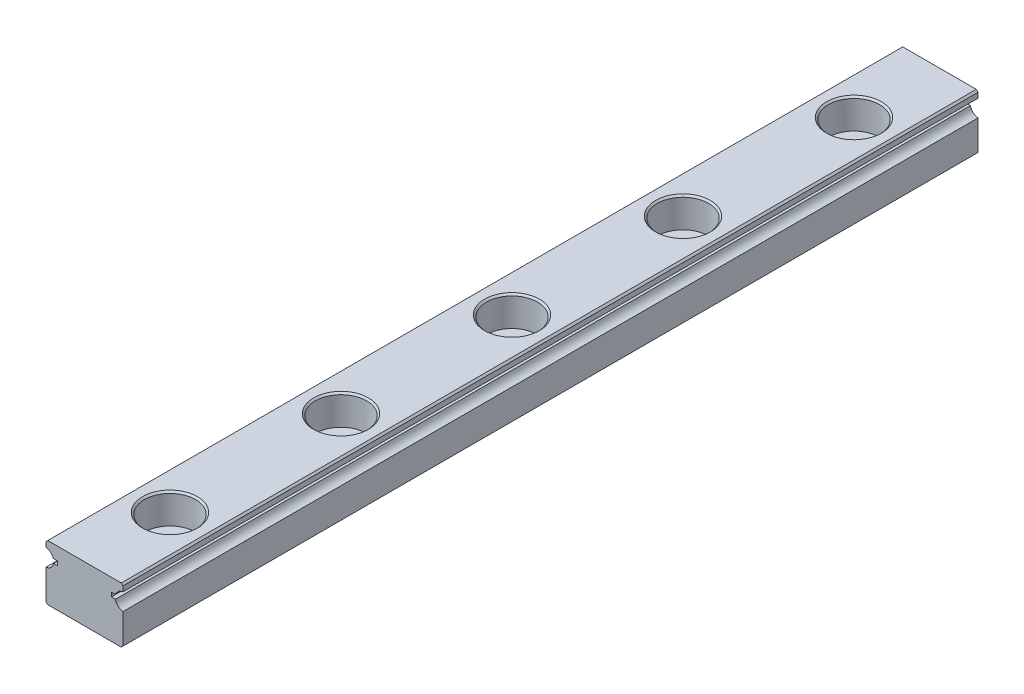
from build123d import *

# Parameters (mm, degrees)
EXTRUDE1_DEPTH             = 250
EXTRUDE2_REACH             = 252.125
SKETCH2_R                  = 1.75
SKETCH_R                   = 3
SKETCH_R_2                 = 1.75
EXTRUDE4_DEPTH             = 3.5
CHAMFER1_SIZE              = 0.2
LPATTERN1_COUNT            = 12
LPATTERN1_PITCH            = 20
CHAMFER1_OF_LPATTERN1_SIZE = 0.2
SKETCH_1_OUTSIDE_W         = 61.05
SKETCH_1_OUTSIDE_H         = 302.05
SKETCH_1_OUTSIDE_W_2       = 30
SKETCH_1_OUTSIDE_H_2       = 100
CUT_EXTRUDE_1_DEPTH        = 10


with BuildPart() as part:
    # Sketch1 → Extrude1 (new body)
    with BuildSketch(Plane.XY):
        with BuildLine():
            Line((-4.3, -3.25), (4.3, -3.25))
            Line((4.3, -3.25), (4.5, -3.05))
            Line((4.5, -3.05), (4.5, 0.455012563))
            ThreePointArc((4.5, 0.455012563), (3.924845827, 0.712323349), (3.617735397, 1.2625))
            Line((3.617735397, 1.2625), (3.15008224, 1.2625))
            Line((3.15008224, 1.2625), (3.15008224, 1.7625))
            Line((3.15008224, 1.7625), (3.65008224, 1.7625))
            ThreePointArc((3.65008224, 1.7625), (3.973877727, 2.229724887), (4.5, 2.444987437))
            Line((4.5, 2.444987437), (4.5, 3.05))
            Line((4.5, 3.05), (4.3, 3.25))
            Line((4.3, 3.25), (-4.3, 3.25))
            Line((-4.3, 3.25), (-4.5, 3.05))
            Line((-4.5, 3.05), (-4.5, 2.444987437))
            ThreePointArc((-4.5, 2.444987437), (-3.973877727, 2.229724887), (-3.65008224, 1.7625))
            Line((-3.65008224, 1.7625), (-3.15008224, 1.7625))
            Line((-3.15008224, 1.7625), (-3.15008224, 1.2625))
            Line((-3.15008224, 1.2625), (-3.617735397, 1.2625))
            ThreePointArc((-3.617735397, 1.2625), (-3.924845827, 0.712323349), (-4.5, 0.455012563))
            Line((-4.5, 0.455012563), (-4.5, -3.05))
            Line((-4.5, -3.05), (-4.3, -3.25))
        make_face()
    extrude(amount=EXTRUDE1_DEPTH)

    # Sketch2 → Extrude2 (cut, up to next)
    with BuildSketch(Plane(origin=(0, 3.25, 0), x_dir=(1, 0, 0), z_dir=(0, 1, 0)), mode=Mode.PRIVATE) as extrude2_sk1:
        with Locations(Location((0, -15, 0), (0, 0, 270))):
            Circle(SKETCH2_R)
    extrude2_tool1 = extrude(extrude2_sk1.sketch, amount=-EXTRUDE2_REACH, mode=Mode.PRIVATE) & part.part
    extrude2 = extrude2_tool1.solids().sort_by_distance((0, 3.25, 15))[0]
    add(extrude2, mode=Mode.SUBTRACT)

    # Sketch → Extrude4 (cut)
    with BuildSketch(Plane(origin=(0, 3.25, 0), x_dir=(1, 0, 0), z_dir=(0, 1, 0))):
        with Locations(Location((0, -15, 0), (0, 0, 270))):
            Circle(SKETCH_R)
        with Locations(Location((0, -15, 0), (0, 0, 270))):
            Circle(SKETCH_R_2, mode=Mode.SUBTRACT)
    extrude4 = extrude(amount=-EXTRUDE4_DEPTH, mode=Mode.SUBTRACT)

    # Chamfer1
    chamfer1_edges = [part.edges().sort_by_distance(p)[0] for p in [
        (0, -3.25, 13.25),
        (0, 3.25, 12),
    ]]
    chamfer(chamfer1_edges, length=CHAMFER1_SIZE)

    # LPattern1: Extrude2, Extrude4 ×12
    with Locations(*[(0, 0, i * LPATTERN1_PITCH) for i in range(1, LPATTERN1_COUNT)]):
        add(extrude2, mode=Mode.SUBTRACT)
        add(extrude4, mode=Mode.SUBTRACT)

    # Chamfer1 of LPattern1
    chamfer1_of_lpattern1_edges = [part.edges().sort_by_distance(p)[0] for p in [
        (0, -3.25, 33.25),
        (0, 3.25, 32),
        (0, -3.25, 53.25),
        (0, 3.25, 52),
        (0, -3.25, 73.25),
        (0, 3.25, 72),
        (0, -3.25, 93.25),
        (0, 3.25, 92),
        (0, -3.25, 113.25),
        (0, 3.25, 112),
        (0, -3.25, 133.25),
        (0, 3.25, 132),
        (0, -3.25, 153.25),
        (0, 3.25, 152),
        (0, -3.25, 173.25),
        (0, 3.25, 172),
        (0, -3.25, 193.25),
        (0, 3.25, 192),
        (0, -3.25, 213.25),
        (0, 3.25, 212),
        (0, -3.25, 233.25),
        (0, 3.25, 232),
    ]]
    chamfer(chamfer1_of_lpattern1_edges, length=CHAMFER1_OF_LPATTERN1_SIZE)

    # Sketch 1 outside → Cut-Extrude 1 (cut)
    with BuildSketch(Plane(origin=(0, 3.25, 0), x_dir=(1, 0, 0), z_dir=(0, 1, 0))):
        with Locations((0, -125)):
            Rectangle(SKETCH_1_OUTSIDE_W, SKETCH_1_OUTSIDE_H)
        with Locations((0, -195)):
            Rectangle(SKETCH_1_OUTSIDE_W_2, SKETCH_1_OUTSIDE_H_2, mode=Mode.SUBTRACT)
    extrude(amount=-CUT_EXTRUDE_1_DEPTH, mode=Mode.SUBTRACT)


solid = part.part
